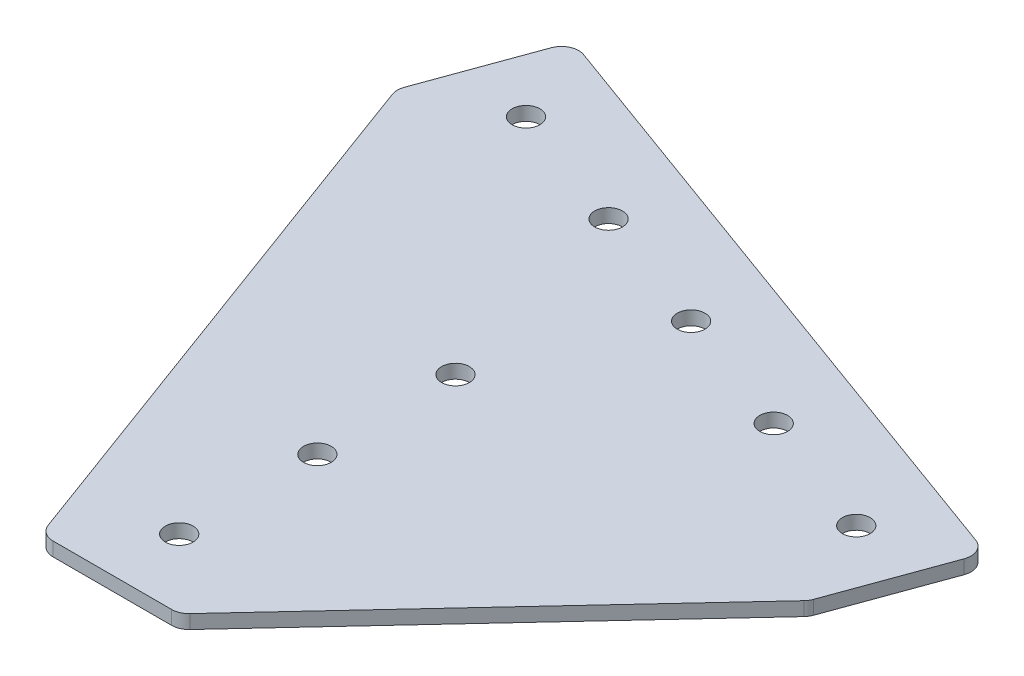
from build123d import *

# Parameters (mm, degrees)
BOSS_EXTRUDE1_DEPTH        = 2.54
F_7_0_201_DIAMETER_HOLE1_D = 5.1054
FILLET1_R                  = 3.175


with BuildPart() as part:
    # Sketch1 → Boss-Extrude1 (new body)
    with BuildSketch(Plane(origin=(0, 0, 0), x_dir=(1, 0, 0), z_dir=(0, 1, 0))):
        Polygon((0, 0), (-38.15203444, 103.451714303), (-29.4647228, 127.319906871), (89.87624004, 83.883348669), (81.1889284, 60.015156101), (25.4, 0), align=None)
    extrude(amount=BOSS_EXTRUDE1_DEPTH)

    # 7 _0.201_ Diameter Hole1 (through all)
    with Locations(Plane(origin=(0, 0, 0), x_dir=(-1, 0, 0), z_dir=(0, -1, 0))):
        with Locations((-73.598487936, 76.292908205), (-49.730295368, 84.980219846), (-25.8621028, 93.667531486), (-1.993910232, 102.354843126), (21.874282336, 111.042154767), (-12.7, 63.5), (-12.7, 38.1), (-12.7, 12.7)):
            Hole(F_7_0_201_DIAMETER_HOLE1_D / 2)

    # Fillet1
    fillet1_edges = [part.edges().sort_by_distance(p)[0] for p in [
        (0, 1.27, 0),
        (-38.15203444, 1.27, -103.451714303),
        (-29.4647228, 1.27, -127.319906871),
        (89.87624004, 1.27, -83.883348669),
        (81.1889284, 1.27, -60.015156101),
        (25.4, 1.27, 0),
    ]]
    fillet(fillet1_edges, radius=FILLET1_R)


solid = part.part
